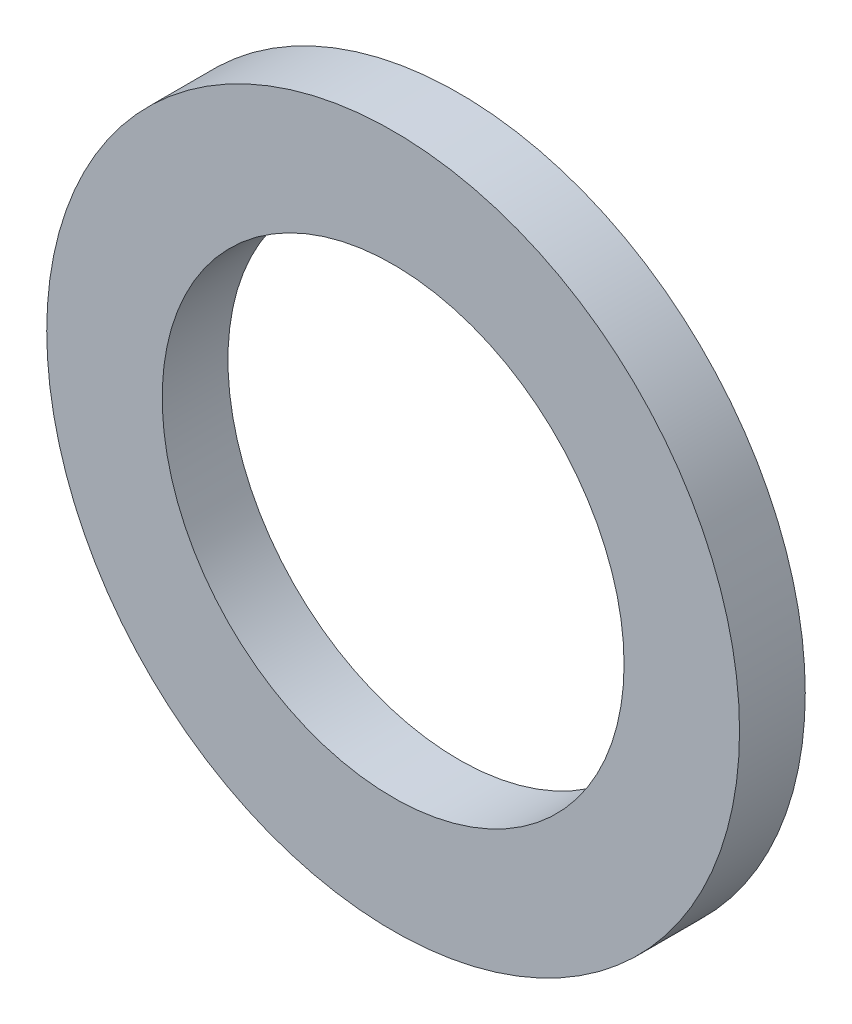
from build123d import *

# Parameters (mm, degrees)
ESQUISSE1_R      = 19.5
ESQUISSE1_R_2    = 13
EXTRUSION1_DEPTH = 1.85


with BuildPart() as part:
    # Esquisse1 → Extrusion1 (new, symmetric)
    with BuildSketch(Plane.XY):
        Circle(ESQUISSE1_R)
        Circle(ESQUISSE1_R_2, mode=Mode.SUBTRACT)
    extrude(amount=EXTRUSION1_DEPTH, both=True)


solid = part.part
